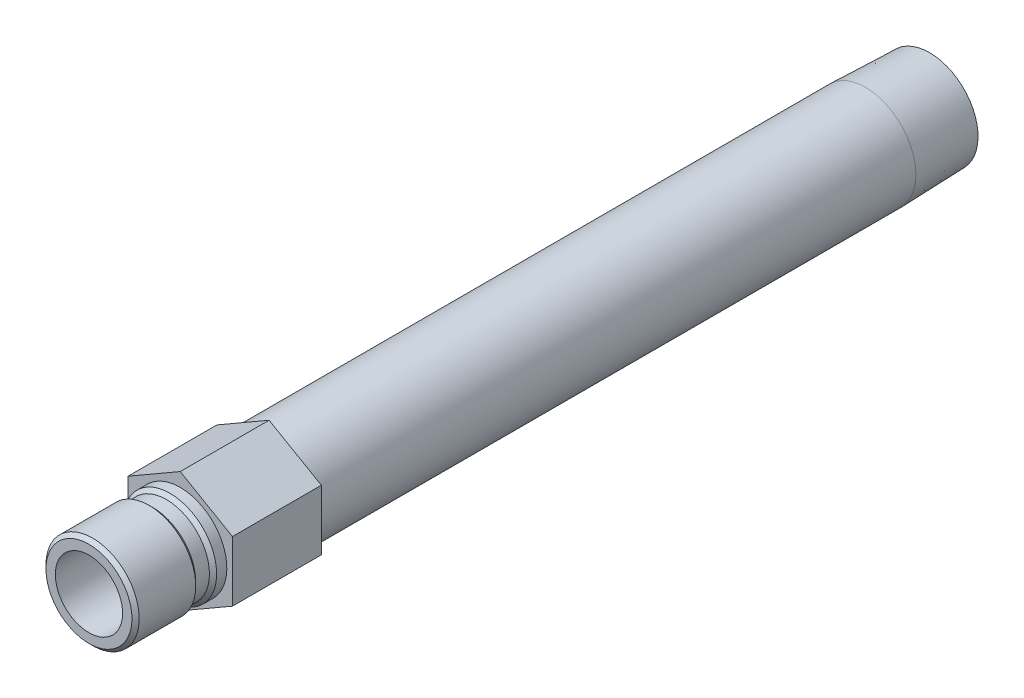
from build123d import *

# Parameters (mm, degrees)
SKETCH2_R           = 7.112
BOSS_EXTRUDE1_DEPTH = 18.796


with BuildPart() as part:
    # Sketch1 → Revolve1 (revolve)
    with BuildSketch(Plane(origin=(0, 0, 0), x_dir=(0, 0, -1), z_dir=(1, 0, 0))):
        Polygon((-19.304, 7.112), (-19.304, 9.0932), (-18.542, 9.8552), (-6.5786, 9.8552), (-5.8166, 9.0932), (-2.921, 9.0932), (-2.159, 9.8552), (0, 9.8552), (0, 10.668), (144.9324, 10.668), (158.496, 10.244140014), (158.496, 7.8994), (-1.105331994, 7.8994), (-1.524, 7.112), align=None)
    revolve(axis=Axis((0, 0, 0), (0, 0, 1)))

    # Sketch2 → Boss-Extrude1 (add)
    with BuildSketch(Plane.XY):
        Polygon((-11.049, 6.379143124), (-11.049, -6.379143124), (0, -12.758286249), (11.049, -6.379143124), (11.049, 6.379143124), (0, 12.758286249), align=None)
        with Locations(Location((0, 0, 0), (0, 0, 90))):
            Circle(SKETCH2_R, mode=Mode.SUBTRACT)
    extrude(amount=-BOSS_EXTRUDE1_DEPTH)


solid = part.part
